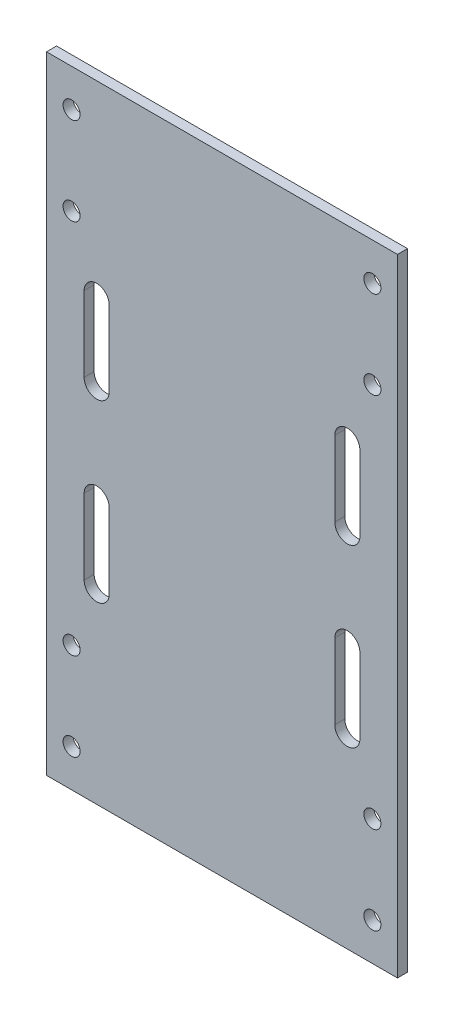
ISO-10303-21;
HEADER;
FILE_DESCRIPTION(('STEP AP214'),'2;1');
FILE_NAME('part.step','',(''),(''),'','','');
FILE_SCHEMA(('AUTOMOTIVE_DESIGN { 1 0 10303 214 1 1 1 1 }'));
ENDSEC;
DATA;
#1=APPLICATION_CONTEXT('core data for automotive mechanical design processes');
#2=APPLICATION_PROTOCOL_DEFINITION('international standard','automotive_design',2000,#1);
#3=PRODUCT_CONTEXT('',#1,'mechanical');
#4=PRODUCT('Part','Part','',(#3));
#5=PRODUCT_RELATED_PRODUCT_CATEGORY('part','',(#4));
#6=PRODUCT_DEFINITION_FORMATION('','',#4);
#7=PRODUCT_DEFINITION_CONTEXT('part definition',#1,'design');
#8=PRODUCT_DEFINITION('design','',#6,#7);
#9=PRODUCT_DEFINITION_SHAPE('','',#8);
#10=(LENGTH_UNIT() NAMED_UNIT(*) SI_UNIT(.MILLI.,.METRE.));
#11=(NAMED_UNIT(*) PLANE_ANGLE_UNIT() SI_UNIT($,.RADIAN.));
#12=(NAMED_UNIT(*) SI_UNIT($,.STERADIAN.) SOLID_ANGLE_UNIT());
#13=UNCERTAINTY_MEASURE_WITH_UNIT(LENGTH_MEASURE(1.E-05),#10,'distance_accuracy_value','');
#14=(GEOMETRIC_REPRESENTATION_CONTEXT(3) GLOBAL_UNCERTAINTY_ASSIGNED_CONTEXT((#13)) GLOBAL_UNIT_ASSIGNED_CONTEXT((#10,
#11,#12)) REPRESENTATION_CONTEXT('',''));
#15=CARTESIAN_POINT('',(0.,0.,0.));
#16=DIRECTION('',(0.,0.,1.));
#17=DIRECTION('',(1.,0.,0.));
#18=AXIS2_PLACEMENT_3D('',#15,#16,#17);
#19=CARTESIAN_POINT('',(0.,0.,0.));
#20=DIRECTION('',(0.,0.,-1.));
#21=DIRECTION('',(-1.,0.,0.));
#22=AXIS2_PLACEMENT_3D('',#19,#20,#21);
#23=PLANE('',#22);
#24=CARTESIAN_POINT('',(25.,-25.,0.));
#25=DIRECTION('',(0.,0.,-1.));
#26=DIRECTION('',(-1.,0.,0.));
#27=AXIS2_PLACEMENT_3D('',#24,#25,#26);
#28=CIRCLE('',#27,2.5);
#29=CARTESIAN_POINT('',(22.5,-25.,0.));
#30=VERTEX_POINT('',#29);
#31=CARTESIAN_POINT('',(27.5,-25.,0.));
#32=VERTEX_POINT('',#31);
#33=EDGE_CURVE('E514',#30,#32,#28,.F.);
#34=ORIENTED_EDGE('',*,*,#33,.F.);
#35=DIRECTION('',(0.,-1.,0.));
#36=VECTOR('',#35,1.);
#37=CARTESIAN_POINT('',(22.5,0.,0.));
#38=LINE('',#37,#36);
#39=CARTESIAN_POINT('',(22.5,-10.,0.));
#40=VERTEX_POINT('',#39);
#41=EDGE_CURVE('E261',#40,#30,#38,.T.);
#42=ORIENTED_EDGE('',*,*,#41,.F.);
#43=CARTESIAN_POINT('',(25.,-10.,0.));
#44=DIRECTION('',(0.,0.,-1.));
#45=DIRECTION('',(-1.,0.,0.));
#46=AXIS2_PLACEMENT_3D('',#43,#44,#45);
#47=CIRCLE('',#46,2.5);
#48=CARTESIAN_POINT('',(27.5,-10.,0.));
#49=VERTEX_POINT('',#48);
#50=EDGE_CURVE('E516',#49,#40,#47,.F.);
#51=ORIENTED_EDGE('',*,*,#50,.F.);
#52=DIRECTION('',(0.,1.,0.));
#53=VECTOR('',#52,1.);
#54=CARTESIAN_POINT('',(27.5,0.,0.));
#55=LINE('',#54,#53);
#56=EDGE_CURVE('E262',#32,#49,#55,.T.);
#57=ORIENTED_EDGE('',*,*,#56,.F.);
#58=EDGE_LOOP('',(#34,#42,#51,#57));
#59=FACE_BOUND('',#58,.T.);
#60=CARTESIAN_POINT('',(-25.,25.,0.));
#61=DIRECTION('',(0.,0.,-1.));
#62=DIRECTION('',(-1.,0.,0.));
#63=AXIS2_PLACEMENT_3D('',#60,#61,#62);
#64=CIRCLE('',#63,2.5);
#65=CARTESIAN_POINT('',(-22.5,25.,0.));
#66=VERTEX_POINT('',#65);
#67=CARTESIAN_POINT('',(-27.5,25.,0.));
#68=VERTEX_POINT('',#67);
#69=EDGE_CURVE('E518',#66,#68,#64,.F.);
#70=ORIENTED_EDGE('',*,*,#69,.F.);
#71=DIRECTION('',(0.,1.,0.));
#72=VECTOR('',#71,1.);
#73=CARTESIAN_POINT('',(-22.5,0.,0.));
#74=LINE('',#73,#72);
#75=CARTESIAN_POINT('',(-22.5,10.,0.));
#76=VERTEX_POINT('',#75);
#77=EDGE_CURVE('E269',#76,#66,#74,.T.);
#78=ORIENTED_EDGE('',*,*,#77,.F.);
#79=CARTESIAN_POINT('',(-25.,10.,0.));
#80=DIRECTION('',(0.,0.,-1.));
#81=DIRECTION('',(-1.,0.,0.));
#82=AXIS2_PLACEMENT_3D('',#79,#80,#81);
#83=CIRCLE('',#82,2.5);
#84=CARTESIAN_POINT('',(-27.5,10.,0.));
#85=VERTEX_POINT('',#84);
#86=EDGE_CURVE('E195',#85,#76,#83,.F.);
#87=ORIENTED_EDGE('',*,*,#86,.F.);
#88=DIRECTION('',(0.,-1.,0.));
#89=VECTOR('',#88,1.);
#90=CARTESIAN_POINT('',(-27.5,0.,0.));
#91=LINE('',#90,#89);
#92=EDGE_CURVE('E270',#68,#85,#91,.T.);
#93=ORIENTED_EDGE('',*,*,#92,.F.);
#94=EDGE_LOOP('',(#70,#78,#87,#93));
#95=FACE_BOUND('',#94,.T.);
#96=CARTESIAN_POINT('',(-25.,-10.,0.));
#97=DIRECTION('',(0.,0.,-1.));
#98=DIRECTION('',(-1.,0.,0.));
#99=AXIS2_PLACEMENT_3D('',#96,#97,#98);
#100=CIRCLE('',#99,2.5);
#101=CARTESIAN_POINT('',(-22.5,-10.,0.));
#102=VERTEX_POINT('',#101);
#103=CARTESIAN_POINT('',(-27.5,-10.,0.));
#104=VERTEX_POINT('',#103);
#105=EDGE_CURVE('E535',#102,#104,#100,.F.);
#106=ORIENTED_EDGE('',*,*,#105,.F.);
#107=DIRECTION('',(0.,1.,0.));
#108=VECTOR('',#107,1.);
#109=CARTESIAN_POINT('',(-22.5,0.,0.));
#110=LINE('',#109,#108);
#111=CARTESIAN_POINT('',(-22.5,-25.,0.));
#112=VERTEX_POINT('',#111);
#113=EDGE_CURVE('E252',#112,#102,#110,.T.);
#114=ORIENTED_EDGE('',*,*,#113,.F.);
#115=CARTESIAN_POINT('',(-25.,-25.,0.));
#116=DIRECTION('',(0.,0.,-1.));
#117=DIRECTION('',(-1.,0.,0.));
#118=AXIS2_PLACEMENT_3D('',#115,#116,#117);
#119=CIRCLE('',#118,2.5);
#120=CARTESIAN_POINT('',(-27.5,-25.,0.));
#121=VERTEX_POINT('',#120);
#122=EDGE_CURVE('E529',#121,#112,#119,.F.);
#123=ORIENTED_EDGE('',*,*,#122,.F.);
#124=DIRECTION('',(0.,-1.,0.));
#125=VECTOR('',#124,1.);
#126=CARTESIAN_POINT('',(-27.5,0.,0.));
#127=LINE('',#126,#125);
#128=EDGE_CURVE('E248',#104,#121,#127,.T.);
#129=ORIENTED_EDGE('',*,*,#128,.F.);
#130=EDGE_LOOP('',(#106,#114,#123,#129));
#131=FACE_BOUND('',#130,.T.);
#132=CARTESIAN_POINT('',(25.,10.,0.));
#133=DIRECTION('',(0.,0.,-1.));
#134=DIRECTION('',(-1.,0.,0.));
#135=AXIS2_PLACEMENT_3D('',#132,#133,#134);
#136=CIRCLE('',#135,2.5);
#137=CARTESIAN_POINT('',(22.5,10.,0.));
#138=VERTEX_POINT('',#137);
#139=CARTESIAN_POINT('',(27.5,10.,0.));
#140=VERTEX_POINT('',#139);
#141=EDGE_CURVE('E525',#138,#140,#136,.F.);
#142=ORIENTED_EDGE('',*,*,#141,.F.);
#143=DIRECTION('',(0.,-1.,0.));
#144=VECTOR('',#143,1.);
#145=CARTESIAN_POINT('',(22.5,0.,0.));
#146=LINE('',#145,#144);
#147=CARTESIAN_POINT('',(22.5,25.,0.));
#148=VERTEX_POINT('',#147);
#149=EDGE_CURVE('E254',#148,#138,#146,.T.);
#150=ORIENTED_EDGE('',*,*,#149,.F.);
#151=CARTESIAN_POINT('',(25.,25.,0.));
#152=DIRECTION('',(0.,0.,-1.));
#153=DIRECTION('',(-1.,0.,0.));
#154=AXIS2_PLACEMENT_3D('',#151,#152,#153);
#155=CIRCLE('',#154,2.5);
#156=CARTESIAN_POINT('',(27.5,25.,0.));
#157=VERTEX_POINT('',#156);
#158=EDGE_CURVE('E526',#157,#148,#155,.F.);
#159=ORIENTED_EDGE('',*,*,#158,.F.);
#160=DIRECTION('',(0.,1.,0.));
#161=VECTOR('',#160,1.);
#162=CARTESIAN_POINT('',(27.5,0.,0.));
#163=LINE('',#162,#161);
#164=EDGE_CURVE('E256',#140,#157,#163,.T.);
#165=ORIENTED_EDGE('',*,*,#164,.F.);
#166=EDGE_LOOP('',(#142,#150,#159,#165));
#167=FACE_BOUND('',#166,.T.);
#168=DIRECTION('',(0.,1.,0.));
#169=VECTOR('',#168,1.);
#170=CARTESIAN_POINT('',(35.,-62.5,0.));
#171=LINE('',#170,#169);
#172=CARTESIAN_POINT('',(35.,-62.5,0.));
#173=VERTEX_POINT('',#172);
#174=CARTESIAN_POINT('',(35.,62.5,0.));
#175=VERTEX_POINT('',#174);
#176=EDGE_CURVE('E825',#173,#175,#171,.T.);
#177=ORIENTED_EDGE('',*,*,#176,.T.);
#178=DIRECTION('',(-1.,0.,0.));
#179=VECTOR('',#178,1.);
#180=CARTESIAN_POINT('',(-35.,62.5,0.));
#181=LINE('',#180,#179);
#182=CARTESIAN_POINT('',(-35.,62.5,0.));
#183=VERTEX_POINT('',#182);
#184=EDGE_CURVE('E824',#175,#183,#181,.T.);
#185=ORIENTED_EDGE('',*,*,#184,.T.);
#186=DIRECTION('',(0.,-1.,0.));
#187=VECTOR('',#186,1.);
#188=CARTESIAN_POINT('',(-35.,-62.5,0.));
#189=LINE('',#188,#187);
#190=CARTESIAN_POINT('',(-35.,-62.5,0.));
#191=VERTEX_POINT('',#190);
#192=EDGE_CURVE('E826',#183,#191,#189,.T.);
#193=ORIENTED_EDGE('',*,*,#192,.T.);
#194=DIRECTION('',(1.,0.,0.));
#195=VECTOR('',#194,1.);
#196=CARTESIAN_POINT('',(-35.,-62.5,0.));
#197=LINE('',#196,#195);
#198=EDGE_CURVE('E830',#191,#173,#197,.T.);
#199=ORIENTED_EDGE('',*,*,#198,.T.);
#200=EDGE_LOOP('',(#177,#185,#193,#199));
#201=FACE_BOUND('',#200,.T.);
#202=CARTESIAN_POINT('',(-30.,-55.,1.2E-05));
#203=DIRECTION('',(0.,0.,1.));
#204=DIRECTION('',(1.,0.,0.));
#205=AXIS2_PLACEMENT_3D('',#202,#203,#204);
#206=CIRCLE('',#205,1.7);
#207=CARTESIAN_POINT('',(-28.3,-55.,1.2E-05));
#208=VERTEX_POINT('',#207);
#209=EDGE_CURVE('E302',#208,#208,#206,.T.);
#210=ORIENTED_EDGE('',*,*,#209,.F.);
#211=EDGE_LOOP('',(#210));
#212=FACE_BOUND('',#211,.T.);
#213=CARTESIAN_POINT('',(30.,55.,1.2E-05));
#214=DIRECTION('',(0.,0.,1.));
#215=DIRECTION('',(1.,0.,0.));
#216=AXIS2_PLACEMENT_3D('',#213,#214,#215);
#217=CIRCLE('',#216,1.7);
#218=CARTESIAN_POINT('',(31.7,55.,1.2E-05));
#219=VERTEX_POINT('',#218);
#220=EDGE_CURVE('E275',#219,#219,#217,.T.);
#221=ORIENTED_EDGE('',*,*,#220,.F.);
#222=EDGE_LOOP('',(#221));
#223=FACE_BOUND('',#222,.T.);
#224=CARTESIAN_POINT('',(30.,37.5,1.2E-05));
#225=DIRECTION('',(0.,0.,1.));
#226=DIRECTION('',(1.,0.,0.));
#227=AXIS2_PLACEMENT_3D('',#224,#225,#226);
#228=CIRCLE('',#227,1.7);
#229=CARTESIAN_POINT('',(31.7,37.5,1.2E-05));
#230=VERTEX_POINT('',#229);
#231=EDGE_CURVE('E282',#230,#230,#228,.T.);
#232=ORIENTED_EDGE('',*,*,#231,.F.);
#233=EDGE_LOOP('',(#232));
#234=FACE_BOUND('',#233,.T.);
#235=CARTESIAN_POINT('',(30.,-37.5,1.2E-05));
#236=DIRECTION('',(0.,0.,1.));
#237=DIRECTION('',(1.,0.,0.));
#238=AXIS2_PLACEMENT_3D('',#235,#236,#237);
#239=CIRCLE('',#238,1.7);
#240=CARTESIAN_POINT('',(31.7,-37.5,1.2E-05));
#241=VERTEX_POINT('',#240);
#242=EDGE_CURVE('E280',#241,#241,#239,.T.);
#243=ORIENTED_EDGE('',*,*,#242,.F.);
#244=EDGE_LOOP('',(#243));
#245=FACE_BOUND('',#244,.T.);
#246=CARTESIAN_POINT('',(-30.,-37.5,1.2E-05));
#247=DIRECTION('',(0.,0.,1.));
#248=DIRECTION('',(1.,0.,0.));
#249=AXIS2_PLACEMENT_3D('',#246,#247,#248);
#250=CIRCLE('',#249,1.7);
#251=CARTESIAN_POINT('',(-28.3,-37.5,1.2E-05));
#252=VERTEX_POINT('',#251);
#253=EDGE_CURVE('E299',#252,#252,#250,.T.);
#254=ORIENTED_EDGE('',*,*,#253,.F.);
#255=EDGE_LOOP('',(#254));
#256=FACE_BOUND('',#255,.T.);
#257=CARTESIAN_POINT('',(-30.,37.5,1.2E-05));
#258=DIRECTION('',(0.,0.,1.));
#259=DIRECTION('',(1.,0.,0.));
#260=AXIS2_PLACEMENT_3D('',#257,#258,#259);
#261=CIRCLE('',#260,1.7);
#262=CARTESIAN_POINT('',(-28.3,37.5,1.2E-05));
#263=VERTEX_POINT('',#262);
#264=EDGE_CURVE('E287',#263,#263,#261,.T.);
#265=ORIENTED_EDGE('',*,*,#264,.F.);
#266=EDGE_LOOP('',(#265));
#267=FACE_BOUND('',#266,.T.);
#268=CARTESIAN_POINT('',(-30.,55.,1.2E-05));
#269=DIRECTION('',(0.,0.,1.));
#270=DIRECTION('',(1.,0.,0.));
#271=AXIS2_PLACEMENT_3D('',#268,#269,#270);
#272=CIRCLE('',#271,1.7);
#273=CARTESIAN_POINT('',(-28.3,55.,1.2E-05));
#274=VERTEX_POINT('',#273);
#275=EDGE_CURVE('E288',#274,#274,#272,.T.);
#276=ORIENTED_EDGE('',*,*,#275,.F.);
#277=EDGE_LOOP('',(#276));
#278=FACE_BOUND('',#277,.T.);
#279=CARTESIAN_POINT('',(30.,-55.,1.2E-05));
#280=DIRECTION('',(0.,0.,1.));
#281=DIRECTION('',(1.,0.,0.));
#282=AXIS2_PLACEMENT_3D('',#279,#280,#281);
#283=CIRCLE('',#282,1.7);
#284=CARTESIAN_POINT('',(31.7,-55.,1.2E-05));
#285=VERTEX_POINT('',#284);
#286=EDGE_CURVE('E277',#285,#285,#283,.T.);
#287=ORIENTED_EDGE('',*,*,#286,.F.);
#288=EDGE_LOOP('',(#287));
#289=FACE_BOUND('',#288,.T.);
#290=ADVANCED_FACE('F39',(#59,#95,#131,#167,#201,#212,#223,#234,#245,#256,#267,#278,#289),#23,.F.);
#291=CARTESIAN_POINT('',(0.,0.,-2.));
#292=DIRECTION('',(0.,0.,-1.));
#293=DIRECTION('',(-1.,0.,0.));
#294=AXIS2_PLACEMENT_3D('',#291,#292,#293);
#295=PLANE('',#294);
#296=CARTESIAN_POINT('',(30.,-55.,-2.));
#297=DIRECTION('',(0.,0.,1.));
#298=DIRECTION('',(1.,0.,0.));
#299=AXIS2_PLACEMENT_3D('',#296,#297,#298);
#300=CIRCLE('',#299,1.7);
#301=CARTESIAN_POINT('',(31.7,-55.,-2.));
#302=VERTEX_POINT('',#301);
#303=EDGE_CURVE('E289',#302,#302,#300,.T.);
#304=ORIENTED_EDGE('',*,*,#303,.T.);
#305=EDGE_LOOP('',(#304));
#306=FACE_BOUND('',#305,.T.);
#307=CARTESIAN_POINT('',(-30.,55.,-2.));
#308=DIRECTION('',(0.,0.,1.));
#309=DIRECTION('',(1.,0.,0.));
#310=AXIS2_PLACEMENT_3D('',#307,#308,#309);
#311=CIRCLE('',#310,1.7);
#312=CARTESIAN_POINT('',(-28.3,55.,-2.));
#313=VERTEX_POINT('',#312);
#314=EDGE_CURVE('E283',#313,#313,#311,.T.);
#315=ORIENTED_EDGE('',*,*,#314,.T.);
#316=EDGE_LOOP('',(#315));
#317=FACE_BOUND('',#316,.T.);
#318=CARTESIAN_POINT('',(-30.,37.5,-2.));
#319=DIRECTION('',(0.,0.,1.));
#320=DIRECTION('',(1.,0.,0.));
#321=AXIS2_PLACEMENT_3D('',#318,#319,#320);
#322=CIRCLE('',#321,1.7);
#323=CARTESIAN_POINT('',(-28.3,37.5,-2.));
#324=VERTEX_POINT('',#323);
#325=EDGE_CURVE('E300',#324,#324,#322,.T.);
#326=ORIENTED_EDGE('',*,*,#325,.T.);
#327=EDGE_LOOP('',(#326));
#328=FACE_BOUND('',#327,.T.);
#329=CARTESIAN_POINT('',(-30.,-37.5,-2.));
#330=DIRECTION('',(0.,0.,1.));
#331=DIRECTION('',(1.,0.,0.));
#332=AXIS2_PLACEMENT_3D('',#329,#330,#331);
#333=CIRCLE('',#332,1.7);
#334=CARTESIAN_POINT('',(-28.3,-37.5,-2.));
#335=VERTEX_POINT('',#334);
#336=EDGE_CURVE('E291',#335,#335,#333,.T.);
#337=ORIENTED_EDGE('',*,*,#336,.T.);
#338=EDGE_LOOP('',(#337));
#339=FACE_BOUND('',#338,.T.);
#340=CARTESIAN_POINT('',(30.,-37.5,-2.));
#341=DIRECTION('',(0.,0.,1.));
#342=DIRECTION('',(1.,0.,0.));
#343=AXIS2_PLACEMENT_3D('',#340,#341,#342);
#344=CIRCLE('',#343,1.7);
#345=CARTESIAN_POINT('',(31.7,-37.5,-2.));
#346=VERTEX_POINT('',#345);
#347=EDGE_CURVE('E272',#346,#346,#344,.T.);
#348=ORIENTED_EDGE('',*,*,#347,.T.);
#349=EDGE_LOOP('',(#348));
#350=FACE_BOUND('',#349,.T.);
#351=CARTESIAN_POINT('',(30.,37.5,-2.));
#352=DIRECTION('',(0.,0.,1.));
#353=DIRECTION('',(1.,0.,0.));
#354=AXIS2_PLACEMENT_3D('',#351,#352,#353);
#355=CIRCLE('',#354,1.7);
#356=CARTESIAN_POINT('',(31.7,37.5,-2.));
#357=VERTEX_POINT('',#356);
#358=EDGE_CURVE('E279',#357,#357,#355,.T.);
#359=ORIENTED_EDGE('',*,*,#358,.T.);
#360=EDGE_LOOP('',(#359));
#361=FACE_BOUND('',#360,.T.);
#362=CARTESIAN_POINT('',(30.,55.,-2.));
#363=DIRECTION('',(0.,0.,1.));
#364=DIRECTION('',(1.,0.,0.));
#365=AXIS2_PLACEMENT_3D('',#362,#363,#364);
#366=CIRCLE('',#365,1.7);
#367=CARTESIAN_POINT('',(31.7,55.,-2.));
#368=VERTEX_POINT('',#367);
#369=EDGE_CURVE('E284',#368,#368,#366,.T.);
#370=ORIENTED_EDGE('',*,*,#369,.T.);
#371=EDGE_LOOP('',(#370));
#372=FACE_BOUND('',#371,.T.);
#373=CARTESIAN_POINT('',(-30.,-55.,-2.));
#374=DIRECTION('',(0.,0.,1.));
#375=DIRECTION('',(1.,0.,0.));
#376=AXIS2_PLACEMENT_3D('',#373,#374,#375);
#377=CIRCLE('',#376,1.7);
#378=CARTESIAN_POINT('',(-28.3,-55.,-2.));
#379=VERTEX_POINT('',#378);
#380=EDGE_CURVE('E297',#379,#379,#377,.T.);
#381=ORIENTED_EDGE('',*,*,#380,.T.);
#382=EDGE_LOOP('',(#381));
#383=FACE_BOUND('',#382,.T.);
#384=DIRECTION('',(0.,1.,0.));
#385=VECTOR('',#384,1.);
#386=CARTESIAN_POINT('',(35.,-62.5,-2.));
#387=LINE('',#386,#385);
#388=CARTESIAN_POINT('',(35.,-62.5,-2.));
#389=VERTEX_POINT('',#388);
#390=CARTESIAN_POINT('',(35.,62.5,-2.));
#391=VERTEX_POINT('',#390);
#392=EDGE_CURVE('E405',#389,#391,#387,.T.);
#393=ORIENTED_EDGE('',*,*,#392,.F.);
#394=DIRECTION('',(1.,0.,0.));
#395=VECTOR('',#394,1.);
#396=CARTESIAN_POINT('',(-35.,-62.5,-2.));
#397=LINE('',#396,#395);
#398=CARTESIAN_POINT('',(-35.,-62.5,-2.));
#399=VERTEX_POINT('',#398);
#400=EDGE_CURVE('E837',#399,#389,#397,.T.);
#401=ORIENTED_EDGE('',*,*,#400,.F.);
#402=DIRECTION('',(0.,-1.,0.));
#403=VECTOR('',#402,1.);
#404=CARTESIAN_POINT('',(-35.,-62.5,-2.));
#405=LINE('',#404,#403);
#406=CARTESIAN_POINT('',(-35.,62.5,-2.));
#407=VERTEX_POINT('',#406);
#408=EDGE_CURVE('E862',#407,#399,#405,.T.);
#409=ORIENTED_EDGE('',*,*,#408,.F.);
#410=DIRECTION('',(-1.,0.,0.));
#411=VECTOR('',#410,1.);
#412=CARTESIAN_POINT('',(-35.,62.5,-2.));
#413=LINE('',#412,#411);
#414=EDGE_CURVE('E832',#391,#407,#413,.T.);
#415=ORIENTED_EDGE('',*,*,#414,.F.);
#416=EDGE_LOOP('',(#393,#401,#409,#415));
#417=FACE_BOUND('',#416,.T.);
#418=DIRECTION('',(0.,1.,0.));
#419=VECTOR('',#418,1.);
#420=CARTESIAN_POINT('',(-22.5,-25.,-2.));
#421=LINE('',#420,#419);
#422=CARTESIAN_POINT('',(-22.5,-25.,-2.));
#423=VERTEX_POINT('',#422);
#424=CARTESIAN_POINT('',(-22.5,-10.,-2.));
#425=VERTEX_POINT('',#424);
#426=EDGE_CURVE('E213',#423,#425,#421,.T.);
#427=ORIENTED_EDGE('',*,*,#426,.T.);
#428=CARTESIAN_POINT('',(-25.,-10.,-2.));
#429=DIRECTION('',(0.,0.,1.));
#430=DIRECTION('',(1.,0.,0.));
#431=AXIS2_PLACEMENT_3D('',#428,#429,#430);
#432=CIRCLE('',#431,2.5);
#433=CARTESIAN_POINT('',(-27.5,-10.,-2.));
#434=VERTEX_POINT('',#433);
#435=EDGE_CURVE('E210',#425,#434,#432,.T.);
#436=ORIENTED_EDGE('',*,*,#435,.T.);
#437=DIRECTION('',(0.,-1.,0.));
#438=VECTOR('',#437,1.);
#439=CARTESIAN_POINT('',(-27.5,-25.,-2.));
#440=LINE('',#439,#438);
#441=CARTESIAN_POINT('',(-27.5,-25.,-2.));
#442=VERTEX_POINT('',#441);
#443=EDGE_CURVE('E216',#434,#442,#440,.T.);
#444=ORIENTED_EDGE('',*,*,#443,.T.);
#445=CARTESIAN_POINT('',(-25.,-25.,-2.));
#446=DIRECTION('',(0.,0.,1.));
#447=DIRECTION('',(1.,0.,0.));
#448=AXIS2_PLACEMENT_3D('',#445,#446,#447);
#449=CIRCLE('',#448,2.5);
#450=EDGE_CURVE('E557',#442,#423,#449,.T.);
#451=ORIENTED_EDGE('',*,*,#450,.T.);
#452=EDGE_LOOP('',(#427,#436,#444,#451));
#453=FACE_BOUND('',#452,.T.);
#454=DIRECTION('',(0.,-1.,0.));
#455=VECTOR('',#454,1.);
#456=CARTESIAN_POINT('',(22.5,10.,-2.));
#457=LINE('',#456,#455);
#458=CARTESIAN_POINT('',(22.5,25.,-2.));
#459=VERTEX_POINT('',#458);
#460=CARTESIAN_POINT('',(22.5,10.,-2.));
#461=VERTEX_POINT('',#460);
#462=EDGE_CURVE('E498',#459,#461,#457,.T.);
#463=ORIENTED_EDGE('',*,*,#462,.T.);
#464=CARTESIAN_POINT('',(25.,10.,-2.));
#465=DIRECTION('',(0.,0.,1.));
#466=DIRECTION('',(1.,0.,0.));
#467=AXIS2_PLACEMENT_3D('',#464,#465,#466);
#468=CIRCLE('',#467,2.5);
#469=CARTESIAN_POINT('',(27.5,10.,-2.));
#470=VERTEX_POINT('',#469);
#471=EDGE_CURVE('E563',#461,#470,#468,.T.);
#472=ORIENTED_EDGE('',*,*,#471,.T.);
#473=DIRECTION('',(0.,1.,0.));
#474=VECTOR('',#473,1.);
#475=CARTESIAN_POINT('',(27.5,10.,-2.));
#476=LINE('',#475,#474);
#477=CARTESIAN_POINT('',(27.5,25.,-2.));
#478=VERTEX_POINT('',#477);
#479=EDGE_CURVE('E221',#470,#478,#476,.T.);
#480=ORIENTED_EDGE('',*,*,#479,.T.);
#481=CARTESIAN_POINT('',(25.,25.,-2.));
#482=DIRECTION('',(0.,0.,1.));
#483=DIRECTION('',(1.,0.,0.));
#484=AXIS2_PLACEMENT_3D('',#481,#482,#483);
#485=CIRCLE('',#484,2.5);
#486=EDGE_CURVE('E565',#478,#459,#485,.T.);
#487=ORIENTED_EDGE('',*,*,#486,.T.);
#488=EDGE_LOOP('',(#463,#472,#480,#487));
#489=FACE_BOUND('',#488,.T.);
#490=DIRECTION('',(0.,-1.,0.));
#491=VECTOR('',#490,1.);
#492=CARTESIAN_POINT('',(22.5,-25.,-2.));
#493=LINE('',#492,#491);
#494=CARTESIAN_POINT('',(22.5,-10.,-2.));
#495=VERTEX_POINT('',#494);
#496=CARTESIAN_POINT('',(22.5,-25.,-2.));
#497=VERTEX_POINT('',#496);
#498=EDGE_CURVE('E231',#495,#497,#493,.T.);
#499=ORIENTED_EDGE('',*,*,#498,.T.);
#500=CARTESIAN_POINT('',(25.,-25.,-2.));
#501=DIRECTION('',(0.,0.,1.));
#502=DIRECTION('',(1.,0.,0.));
#503=AXIS2_PLACEMENT_3D('',#500,#501,#502);
#504=CIRCLE('',#503,2.5);
#505=CARTESIAN_POINT('',(27.5,-25.,-2.));
#506=VERTEX_POINT('',#505);
#507=EDGE_CURVE('E501',#497,#506,#504,.T.);
#508=ORIENTED_EDGE('',*,*,#507,.T.);
#509=DIRECTION('',(0.,1.,0.));
#510=VECTOR('',#509,1.);
#511=CARTESIAN_POINT('',(27.5,-25.,-2.));
#512=LINE('',#511,#510);
#513=CARTESIAN_POINT('',(27.5,-10.,-2.));
#514=VERTEX_POINT('',#513);
#515=EDGE_CURVE('E233',#506,#514,#512,.T.);
#516=ORIENTED_EDGE('',*,*,#515,.T.);
#517=CARTESIAN_POINT('',(25.,-10.,-2.));
#518=DIRECTION('',(0.,0.,1.));
#519=DIRECTION('',(1.,0.,0.));
#520=AXIS2_PLACEMENT_3D('',#517,#518,#519);
#521=CIRCLE('',#520,2.5);
#522=EDGE_CURVE('E506',#514,#495,#521,.T.);
#523=ORIENTED_EDGE('',*,*,#522,.T.);
#524=EDGE_LOOP('',(#499,#508,#516,#523));
#525=FACE_BOUND('',#524,.T.);
#526=DIRECTION('',(0.,1.,0.));
#527=VECTOR('',#526,1.);
#528=CARTESIAN_POINT('',(-22.5,10.,-2.));
#529=LINE('',#528,#527);
#530=CARTESIAN_POINT('',(-22.5,10.,-2.));
#531=VERTEX_POINT('',#530);
#532=CARTESIAN_POINT('',(-22.5,25.,-2.));
#533=VERTEX_POINT('',#532);
#534=EDGE_CURVE('E202',#531,#533,#529,.T.);
#535=ORIENTED_EDGE('',*,*,#534,.T.);
#536=CARTESIAN_POINT('',(-25.,25.,-2.));
#537=DIRECTION('',(0.,0.,1.));
#538=DIRECTION('',(1.,0.,0.));
#539=AXIS2_PLACEMENT_3D('',#536,#537,#538);
#540=CIRCLE('',#539,2.5);
#541=CARTESIAN_POINT('',(-27.5,25.,-2.));
#542=VERTEX_POINT('',#541);
#543=EDGE_CURVE('E208',#533,#542,#540,.T.);
#544=ORIENTED_EDGE('',*,*,#543,.T.);
#545=DIRECTION('',(0.,-1.,0.));
#546=VECTOR('',#545,1.);
#547=CARTESIAN_POINT('',(-27.5,10.,-2.));
#548=LINE('',#547,#546);
#549=CARTESIAN_POINT('',(-27.5,10.,-2.));
#550=VERTEX_POINT('',#549);
#551=EDGE_CURVE('E197',#542,#550,#548,.T.);
#552=ORIENTED_EDGE('',*,*,#551,.T.);
#553=CARTESIAN_POINT('',(-25.,10.,-2.));
#554=DIRECTION('',(0.,0.,1.));
#555=DIRECTION('',(1.,0.,0.));
#556=AXIS2_PLACEMENT_3D('',#553,#554,#555);
#557=CIRCLE('',#556,2.5);
#558=EDGE_CURVE('E186',#550,#531,#557,.T.);
#559=ORIENTED_EDGE('',*,*,#558,.T.);
#560=EDGE_LOOP('',(#535,#544,#552,#559));
#561=FACE_BOUND('',#560,.T.);
#562=ADVANCED_FACE('F201',(#306,#317,#328,#339,#350,#361,#372,#383,#417,#453,#489,#525,#561),
#295,.T.);
#563=CARTESIAN_POINT('',(35.,-62.5,-2.));
#564=DIRECTION('',(1.,0.,0.));
#565=DIRECTION('',(0.,0.,-1.));
#566=AXIS2_PLACEMENT_3D('',#563,#564,#565);
#567=PLANE('',#566);
#568=ORIENTED_EDGE('',*,*,#176,.F.);
#569=DIRECTION('',(0.,0.,1.));
#570=VECTOR('',#569,1.);
#571=CARTESIAN_POINT('',(35.,-62.5,-2.));
#572=LINE('',#571,#570);
#573=EDGE_CURVE('E11',#389,#173,#572,.T.);
#574=ORIENTED_EDGE('',*,*,#573,.F.);
#575=ORIENTED_EDGE('',*,*,#392,.T.);
#576=DIRECTION('',(0.,0.,1.));
#577=VECTOR('',#576,1.);
#578=CARTESIAN_POINT('',(35.,62.5,-2.));
#579=LINE('',#578,#577);
#580=EDGE_CURVE('E88',#391,#175,#579,.T.);
#581=ORIENTED_EDGE('',*,*,#580,.T.);
#582=EDGE_LOOP('',(#568,#574,#575,#581));
#583=FACE_BOUND('',#582,.T.);
#584=ADVANCED_FACE('F41',(#583),#567,.T.);
#585=CARTESIAN_POINT('',(-35.,-62.5,-2.));
#586=DIRECTION('',(0.,-1.,0.));
#587=DIRECTION('',(0.,0.,-1.));
#588=AXIS2_PLACEMENT_3D('',#585,#586,#587);
#589=PLANE('',#588);
#590=ORIENTED_EDGE('',*,*,#198,.F.);
#591=DIRECTION('',(0.,0.,1.));
#592=VECTOR('',#591,1.);
#593=CARTESIAN_POINT('',(-35.,-62.5,-2.));
#594=LINE('',#593,#592);
#595=EDGE_CURVE('E51',#399,#191,#594,.T.);
#596=ORIENTED_EDGE('',*,*,#595,.F.);
#597=ORIENTED_EDGE('',*,*,#400,.T.);
#598=ORIENTED_EDGE('',*,*,#573,.T.);
#599=EDGE_LOOP('',(#590,#596,#597,#598));
#600=FACE_BOUND('',#599,.T.);
#601=ADVANCED_FACE('F419',(#600),#589,.T.);
#602=CARTESIAN_POINT('',(-35.,-62.5,-2.));
#603=DIRECTION('',(-1.,0.,0.));
#604=DIRECTION('',(0.,0.,1.));
#605=AXIS2_PLACEMENT_3D('',#602,#603,#604);
#606=PLANE('',#605);
#607=ORIENTED_EDGE('',*,*,#192,.F.);
#608=DIRECTION('',(0.,0.,1.));
#609=VECTOR('',#608,1.);
#610=CARTESIAN_POINT('',(-35.,62.5,-2.));
#611=LINE('',#610,#609);
#612=EDGE_CURVE('E836',#407,#183,#611,.T.);
#613=ORIENTED_EDGE('',*,*,#612,.F.);
#614=ORIENTED_EDGE('',*,*,#408,.T.);
#615=ORIENTED_EDGE('',*,*,#595,.T.);
#616=EDGE_LOOP('',(#607,#613,#614,#615));
#617=FACE_BOUND('',#616,.T.);
#618=ADVANCED_FACE('F699',(#617),#606,.T.);
#619=CARTESIAN_POINT('',(-35.,62.5,-2.));
#620=DIRECTION('',(0.,1.,0.));
#621=DIRECTION('',(0.,0.,1.));
#622=AXIS2_PLACEMENT_3D('',#619,#620,#621);
#623=PLANE('',#622);
#624=ORIENTED_EDGE('',*,*,#184,.F.);
#625=ORIENTED_EDGE('',*,*,#580,.F.);
#626=ORIENTED_EDGE('',*,*,#414,.T.);
#627=ORIENTED_EDGE('',*,*,#612,.T.);
#628=EDGE_LOOP('',(#624,#625,#626,#627));
#629=FACE_BOUND('',#628,.T.);
#630=ADVANCED_FACE('F412',(#629),#623,.T.);
#631=CARTESIAN_POINT('',(-30.,-55.,1.2E-05));
#632=DIRECTION('',(0.,0.,-1.));
#633=DIRECTION('',(-1.,0.,0.));
#634=AXIS2_PLACEMENT_3D('',#631,#632,#633);
#635=CYLINDRICAL_SURFACE('',#634,1.7);
#636=ORIENTED_EDGE('',*,*,#209,.T.);
#637=EDGE_LOOP('',(#636));
#638=FACE_BOUND('',#637,.T.);
#639=ORIENTED_EDGE('',*,*,#380,.F.);
#640=EDGE_LOOP('',(#639));
#641=FACE_BOUND('',#640,.T.);
#642=ADVANCED_FACE('F404',(#638,#641),#635,.F.);
#643=CARTESIAN_POINT('',(30.,55.,1.2E-05));
#644=DIRECTION('',(0.,0.,-1.));
#645=DIRECTION('',(-1.,0.,0.));
#646=AXIS2_PLACEMENT_3D('',#643,#644,#645);
#647=CYLINDRICAL_SURFACE('',#646,1.7);
#648=ORIENTED_EDGE('',*,*,#220,.T.);
#649=EDGE_LOOP('',(#648));
#650=FACE_BOUND('',#649,.T.);
#651=ORIENTED_EDGE('',*,*,#369,.F.);
#652=EDGE_LOOP('',(#651));
#653=FACE_BOUND('',#652,.T.);
#654=ADVANCED_FACE('F375',(#650,#653),#647,.F.);
#655=CARTESIAN_POINT('',(30.,37.5,1.2E-05));
#656=DIRECTION('',(0.,0.,-1.));
#657=DIRECTION('',(-1.,0.,0.));
#658=AXIS2_PLACEMENT_3D('',#655,#656,#657);
#659=CYLINDRICAL_SURFACE('',#658,1.7);
#660=ORIENTED_EDGE('',*,*,#231,.T.);
#661=EDGE_LOOP('',(#660));
#662=FACE_BOUND('',#661,.T.);
#663=ORIENTED_EDGE('',*,*,#358,.F.);
#664=EDGE_LOOP('',(#663));
#665=FACE_BOUND('',#664,.T.);
#666=ADVANCED_FACE('F366',(#662,#665),#659,.F.);
#667=CARTESIAN_POINT('',(30.,-37.5,1.2E-05));
#668=DIRECTION('',(0.,0.,-1.));
#669=DIRECTION('',(-1.,0.,0.));
#670=AXIS2_PLACEMENT_3D('',#667,#668,#669);
#671=CYLINDRICAL_SURFACE('',#670,1.7);
#672=ORIENTED_EDGE('',*,*,#242,.T.);
#673=EDGE_LOOP('',(#672));
#674=FACE_BOUND('',#673,.T.);
#675=ORIENTED_EDGE('',*,*,#347,.F.);
#676=EDGE_LOOP('',(#675));
#677=FACE_BOUND('',#676,.T.);
#678=ADVANCED_FACE('F334',(#674,#677),#671,.F.);
#679=CARTESIAN_POINT('',(-30.,-37.5,1.2E-05));
#680=DIRECTION('',(0.,0.,-1.));
#681=DIRECTION('',(-1.,0.,0.));
#682=AXIS2_PLACEMENT_3D('',#679,#680,#681);
#683=CYLINDRICAL_SURFACE('',#682,1.7);
#684=ORIENTED_EDGE('',*,*,#253,.T.);
#685=EDGE_LOOP('',(#684));
#686=FACE_BOUND('',#685,.T.);
#687=ORIENTED_EDGE('',*,*,#336,.F.);
#688=EDGE_LOOP('',(#687));
#689=FACE_BOUND('',#688,.T.);
#690=ADVANCED_FACE('F327',(#686,#689),#683,.F.);
#691=CARTESIAN_POINT('',(-30.,37.5,1.2E-05));
#692=DIRECTION('',(0.,0.,-1.));
#693=DIRECTION('',(-1.,0.,0.));
#694=AXIS2_PLACEMENT_3D('',#691,#692,#693);
#695=CYLINDRICAL_SURFACE('',#694,1.7);
#696=ORIENTED_EDGE('',*,*,#264,.T.);
#697=EDGE_LOOP('',(#696));
#698=FACE_BOUND('',#697,.T.);
#699=ORIENTED_EDGE('',*,*,#325,.F.);
#700=EDGE_LOOP('',(#699));
#701=FACE_BOUND('',#700,.T.);
#702=ADVANCED_FACE('F335',(#698,#701),#695,.F.);
#703=CARTESIAN_POINT('',(-30.,55.,1.2E-05));
#704=DIRECTION('',(0.,0.,-1.));
#705=DIRECTION('',(-1.,0.,0.));
#706=AXIS2_PLACEMENT_3D('',#703,#704,#705);
#707=CYLINDRICAL_SURFACE('',#706,1.7);
#708=ORIENTED_EDGE('',*,*,#275,.T.);
#709=EDGE_LOOP('',(#708));
#710=FACE_BOUND('',#709,.T.);
#711=ORIENTED_EDGE('',*,*,#314,.F.);
#712=EDGE_LOOP('',(#711));
#713=FACE_BOUND('',#712,.T.);
#714=ADVANCED_FACE('F324',(#710,#713),#707,.F.);
#715=CARTESIAN_POINT('',(30.,-55.,1.2E-05));
#716=DIRECTION('',(0.,0.,-1.));
#717=DIRECTION('',(-1.,0.,0.));
#718=AXIS2_PLACEMENT_3D('',#715,#716,#717);
#719=CYLINDRICAL_SURFACE('',#718,1.7);
#720=ORIENTED_EDGE('',*,*,#286,.T.);
#721=EDGE_LOOP('',(#720));
#722=FACE_BOUND('',#721,.T.);
#723=ORIENTED_EDGE('',*,*,#303,.F.);
#724=EDGE_LOOP('',(#723));
#725=FACE_BOUND('',#724,.T.);
#726=ADVANCED_FACE('F314',(#722,#725),#719,.F.);
#727=CARTESIAN_POINT('',(-22.5,-25.,0.082677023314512));
#728=DIRECTION('',(-1.,0.,0.));
#729=DIRECTION('',(0.,0.,1.));
#730=AXIS2_PLACEMENT_3D('',#727,#728,#729);
#731=PLANE('',#730);
#732=ORIENTED_EDGE('',*,*,#113,.T.);
#733=DIRECTION('',(0.,0.,-1.));
#734=VECTOR('',#733,1.);
#735=CARTESIAN_POINT('',(-22.5,-10.,0.082677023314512));
#736=LINE('',#735,#734);
#737=EDGE_CURVE('E246',#102,#425,#736,.T.);
#738=ORIENTED_EDGE('',*,*,#737,.T.);
#739=ORIENTED_EDGE('',*,*,#426,.F.);
#740=DIRECTION('',(0.,0.,-1.));
#741=VECTOR('',#740,1.);
#742=CARTESIAN_POINT('',(-22.5,-25.,0.082677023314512));
#743=LINE('',#742,#741);
#744=EDGE_CURVE('E239',#112,#423,#743,.T.);
#745=ORIENTED_EDGE('',*,*,#744,.F.);
#746=EDGE_LOOP('',(#732,#738,#739,#745));
#747=FACE_BOUND('',#746,.T.);
#748=ADVANCED_FACE('F322',(#747),#731,.T.);
#749=CARTESIAN_POINT('',(-27.5,-25.,0.082677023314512));
#750=DIRECTION('',(1.,0.,0.));
#751=DIRECTION('',(0.,0.,-1.));
#752=AXIS2_PLACEMENT_3D('',#749,#750,#751);
#753=PLANE('',#752);
#754=ORIENTED_EDGE('',*,*,#128,.T.);
#755=DIRECTION('',(0.,0.,-1.));
#756=VECTOR('',#755,1.);
#757=CARTESIAN_POINT('',(-27.5,-25.,0.082677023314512));
#758=LINE('',#757,#756);
#759=EDGE_CURVE('E242',#121,#442,#758,.T.);
#760=ORIENTED_EDGE('',*,*,#759,.T.);
#761=ORIENTED_EDGE('',*,*,#443,.F.);
#762=DIRECTION('',(0.,0.,-1.));
#763=VECTOR('',#762,1.);
#764=CARTESIAN_POINT('',(-27.5,-10.,0.082677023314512));
#765=LINE('',#764,#763);
#766=EDGE_CURVE('E241',#104,#434,#765,.T.);
#767=ORIENTED_EDGE('',*,*,#766,.F.);
#768=EDGE_LOOP('',(#754,#760,#761,#767));
#769=FACE_BOUND('',#768,.T.);
#770=ADVANCED_FACE('F614',(#769),#753,.T.);
#771=CARTESIAN_POINT('',(27.5,10.,0.082677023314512));
#772=DIRECTION('',(-1.,0.,0.));
#773=DIRECTION('',(0.,0.,1.));
#774=AXIS2_PLACEMENT_3D('',#771,#772,#773);
#775=PLANE('',#774);
#776=ORIENTED_EDGE('',*,*,#164,.T.);
#777=DIRECTION('',(0.,0.,-1.));
#778=VECTOR('',#777,1.);
#779=CARTESIAN_POINT('',(27.5,25.,0.082677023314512));
#780=LINE('',#779,#778);
#781=EDGE_CURVE('E534',#157,#478,#780,.T.);
#782=ORIENTED_EDGE('',*,*,#781,.T.);
#783=ORIENTED_EDGE('',*,*,#479,.F.);
#784=DIRECTION('',(0.,0.,-1.));
#785=VECTOR('',#784,1.);
#786=CARTESIAN_POINT('',(27.5,10.,0.082677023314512));
#787=LINE('',#786,#785);
#788=EDGE_CURVE('E545',#140,#470,#787,.T.);
#789=ORIENTED_EDGE('',*,*,#788,.F.);
#790=EDGE_LOOP('',(#776,#782,#783,#789));
#791=FACE_BOUND('',#790,.T.);
#792=ADVANCED_FACE('F568',(#791),#775,.T.);
#793=CARTESIAN_POINT('',(22.5,10.,0.082677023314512));
#794=DIRECTION('',(1.,0.,0.));
#795=DIRECTION('',(0.,0.,-1.));
#796=AXIS2_PLACEMENT_3D('',#793,#794,#795);
#797=PLANE('',#796);
#798=ORIENTED_EDGE('',*,*,#149,.T.);
#799=DIRECTION('',(0.,0.,-1.));
#800=VECTOR('',#799,1.);
#801=CARTESIAN_POINT('',(22.5,10.,0.082677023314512));
#802=LINE('',#801,#800);
#803=EDGE_CURVE('E537',#138,#461,#802,.T.);
#804=ORIENTED_EDGE('',*,*,#803,.T.);
#805=ORIENTED_EDGE('',*,*,#462,.F.);
#806=DIRECTION('',(0.,0.,-1.));
#807=VECTOR('',#806,1.);
#808=CARTESIAN_POINT('',(22.5,25.,0.082677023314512));
#809=LINE('',#808,#807);
#810=EDGE_CURVE('E540',#148,#459,#809,.T.);
#811=ORIENTED_EDGE('',*,*,#810,.F.);
#812=EDGE_LOOP('',(#798,#804,#805,#811));
#813=FACE_BOUND('',#812,.T.);
#814=ADVANCED_FACE('F583',(#813),#797,.T.);
#815=CARTESIAN_POINT('',(27.5,-25.,0.082677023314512));
#816=DIRECTION('',(-1.,0.,0.));
#817=DIRECTION('',(0.,0.,1.));
#818=AXIS2_PLACEMENT_3D('',#815,#816,#817);
#819=PLANE('',#818);
#820=ORIENTED_EDGE('',*,*,#56,.T.);
#821=DIRECTION('',(0.,0.,-1.));
#822=VECTOR('',#821,1.);
#823=CARTESIAN_POINT('',(27.5,-10.,0.082677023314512));
#824=LINE('',#823,#822);
#825=EDGE_CURVE('E219',#49,#514,#824,.T.);
#826=ORIENTED_EDGE('',*,*,#825,.T.);
#827=ORIENTED_EDGE('',*,*,#515,.F.);
#828=DIRECTION('',(0.,0.,-1.));
#829=VECTOR('',#828,1.);
#830=CARTESIAN_POINT('',(27.5,-25.,0.082677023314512));
#831=LINE('',#830,#829);
#832=EDGE_CURVE('E226',#32,#506,#831,.T.);
#833=ORIENTED_EDGE('',*,*,#832,.F.);
#834=EDGE_LOOP('',(#820,#826,#827,#833));
#835=FACE_BOUND('',#834,.T.);
#836=ADVANCED_FACE('F613',(#835),#819,.T.);
#837=CARTESIAN_POINT('',(22.5,-25.,0.082677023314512));
#838=DIRECTION('',(1.,0.,0.));
#839=DIRECTION('',(0.,0.,-1.));
#840=AXIS2_PLACEMENT_3D('',#837,#838,#839);
#841=PLANE('',#840);
#842=ORIENTED_EDGE('',*,*,#41,.T.);
#843=DIRECTION('',(0.,0.,-1.));
#844=VECTOR('',#843,1.);
#845=CARTESIAN_POINT('',(22.5,-25.,0.082677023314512));
#846=LINE('',#845,#844);
#847=EDGE_CURVE('E227',#30,#497,#846,.T.);
#848=ORIENTED_EDGE('',*,*,#847,.T.);
#849=ORIENTED_EDGE('',*,*,#498,.F.);
#850=DIRECTION('',(0.,0.,-1.));
#851=VECTOR('',#850,1.);
#852=CARTESIAN_POINT('',(22.5,-10.,0.082677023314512));
#853=LINE('',#852,#851);
#854=EDGE_CURVE('E224',#40,#495,#853,.T.);
#855=ORIENTED_EDGE('',*,*,#854,.F.);
#856=EDGE_LOOP('',(#842,#848,#849,#855));
#857=FACE_BOUND('',#856,.T.);
#858=ADVANCED_FACE('F508',(#857),#841,.T.);
#859=CARTESIAN_POINT('',(-22.5,10.,0.082677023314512));
#860=DIRECTION('',(-1.,0.,0.));
#861=DIRECTION('',(0.,0.,1.));
#862=AXIS2_PLACEMENT_3D('',#859,#860,#861);
#863=PLANE('',#862);
#864=ORIENTED_EDGE('',*,*,#77,.T.);
#865=DIRECTION('',(0.,0.,-1.));
#866=VECTOR('',#865,1.);
#867=CARTESIAN_POINT('',(-22.5,25.,0.082677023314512));
#868=LINE('',#867,#866);
#869=EDGE_CURVE('E215',#66,#533,#868,.T.);
#870=ORIENTED_EDGE('',*,*,#869,.T.);
#871=ORIENTED_EDGE('',*,*,#534,.F.);
#872=DIRECTION('',(0.,0.,-1.));
#873=VECTOR('',#872,1.);
#874=CARTESIAN_POINT('',(-22.5,10.,0.082677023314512));
#875=LINE('',#874,#873);
#876=EDGE_CURVE('E187',#76,#531,#875,.T.);
#877=ORIENTED_EDGE('',*,*,#876,.F.);
#878=EDGE_LOOP('',(#864,#870,#871,#877));
#879=FACE_BOUND('',#878,.T.);
#880=ADVANCED_FACE('F211',(#879),#863,.T.);
#881=CARTESIAN_POINT('',(-27.5,10.,0.082677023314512));
#882=DIRECTION('',(1.,0.,0.));
#883=DIRECTION('',(0.,0.,-1.));
#884=AXIS2_PLACEMENT_3D('',#881,#882,#883);
#885=PLANE('',#884);
#886=ORIENTED_EDGE('',*,*,#92,.T.);
#887=DIRECTION('',(0.,0.,-1.));
#888=VECTOR('',#887,1.);
#889=CARTESIAN_POINT('',(-27.5,10.,0.082677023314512));
#890=LINE('',#889,#888);
#891=EDGE_CURVE('E196',#85,#550,#890,.T.);
#892=ORIENTED_EDGE('',*,*,#891,.T.);
#893=ORIENTED_EDGE('',*,*,#551,.F.);
#894=DIRECTION('',(0.,0.,-1.));
#895=VECTOR('',#894,1.);
#896=CARTESIAN_POINT('',(-27.5,25.,0.082677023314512));
#897=LINE('',#896,#895);
#898=EDGE_CURVE('E547',#68,#542,#897,.T.);
#899=ORIENTED_EDGE('',*,*,#898,.F.);
#900=EDGE_LOOP('',(#886,#892,#893,#899));
#901=FACE_BOUND('',#900,.T.);
#902=ADVANCED_FACE('F552',(#901),#885,.T.);
#903=CARTESIAN_POINT('',(-25.,10.,0.082677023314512));
#904=DIRECTION('',(0.,0.,-1.));
#905=DIRECTION('',(-1.,0.,0.));
#906=AXIS2_PLACEMENT_3D('',#903,#904,#905);
#907=CYLINDRICAL_SURFACE('',#906,2.5);
#908=ORIENTED_EDGE('',*,*,#558,.F.);
#909=ORIENTED_EDGE('',*,*,#891,.F.);
#910=ORIENTED_EDGE('',*,*,#86,.T.);
#911=ORIENTED_EDGE('',*,*,#876,.T.);
#912=EDGE_LOOP('',(#908,#909,#910,#911));
#913=FACE_BOUND('',#912,.T.);
#914=ADVANCED_FACE('F190',(#913),#907,.F.);
#915=CARTESIAN_POINT('',(-25.,25.,0.082677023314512));
#916=DIRECTION('',(0.,0.,-1.));
#917=DIRECTION('',(-1.,0.,0.));
#918=AXIS2_PLACEMENT_3D('',#915,#916,#917);
#919=CYLINDRICAL_SURFACE('',#918,2.5);
#920=ORIENTED_EDGE('',*,*,#69,.T.);
#921=ORIENTED_EDGE('',*,*,#898,.T.);
#922=ORIENTED_EDGE('',*,*,#543,.F.);
#923=ORIENTED_EDGE('',*,*,#869,.F.);
#924=EDGE_LOOP('',(#920,#921,#922,#923));
#925=FACE_BOUND('',#924,.T.);
#926=ADVANCED_FACE('F594',(#925),#919,.F.);
#927=CARTESIAN_POINT('',(25.,-25.,0.082677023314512));
#928=DIRECTION('',(0.,0.,-1.));
#929=DIRECTION('',(-1.,0.,0.));
#930=AXIS2_PLACEMENT_3D('',#927,#928,#929);
#931=CYLINDRICAL_SURFACE('',#930,2.5);
#932=ORIENTED_EDGE('',*,*,#507,.F.);
#933=ORIENTED_EDGE('',*,*,#847,.F.);
#934=ORIENTED_EDGE('',*,*,#33,.T.);
#935=ORIENTED_EDGE('',*,*,#832,.T.);
#936=EDGE_LOOP('',(#932,#933,#934,#935));
#937=FACE_BOUND('',#936,.T.);
#938=ADVANCED_FACE('F511',(#937),#931,.F.);
#939=CARTESIAN_POINT('',(25.,-10.,0.082677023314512));
#940=DIRECTION('',(0.,0.,-1.));
#941=DIRECTION('',(-1.,0.,0.));
#942=AXIS2_PLACEMENT_3D('',#939,#940,#941);
#943=CYLINDRICAL_SURFACE('',#942,2.5);
#944=ORIENTED_EDGE('',*,*,#50,.T.);
#945=ORIENTED_EDGE('',*,*,#854,.T.);
#946=ORIENTED_EDGE('',*,*,#522,.F.);
#947=ORIENTED_EDGE('',*,*,#825,.F.);
#948=EDGE_LOOP('',(#944,#945,#946,#947));
#949=FACE_BOUND('',#948,.T.);
#950=ADVANCED_FACE('F585',(#949),#943,.F.);
#951=CARTESIAN_POINT('',(25.,10.,0.082677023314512));
#952=DIRECTION('',(0.,0.,-1.));
#953=DIRECTION('',(-1.,0.,0.));
#954=AXIS2_PLACEMENT_3D('',#951,#952,#953);
#955=CYLINDRICAL_SURFACE('',#954,2.5);
#956=ORIENTED_EDGE('',*,*,#471,.F.);
#957=ORIENTED_EDGE('',*,*,#803,.F.);
#958=ORIENTED_EDGE('',*,*,#141,.T.);
#959=ORIENTED_EDGE('',*,*,#788,.T.);
#960=EDGE_LOOP('',(#956,#957,#958,#959));
#961=FACE_BOUND('',#960,.T.);
#962=ADVANCED_FACE('F582',(#961),#955,.F.);
#963=CARTESIAN_POINT('',(25.,25.,0.082677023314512));
#964=DIRECTION('',(0.,0.,-1.));
#965=DIRECTION('',(-1.,0.,0.));
#966=AXIS2_PLACEMENT_3D('',#963,#964,#965);
#967=CYLINDRICAL_SURFACE('',#966,2.5);
#968=ORIENTED_EDGE('',*,*,#158,.T.);
#969=ORIENTED_EDGE('',*,*,#810,.T.);
#970=ORIENTED_EDGE('',*,*,#486,.F.);
#971=ORIENTED_EDGE('',*,*,#781,.F.);
#972=EDGE_LOOP('',(#968,#969,#970,#971));
#973=FACE_BOUND('',#972,.T.);
#974=ADVANCED_FACE('F571',(#973),#967,.F.);
#975=CARTESIAN_POINT('',(-25.,-25.,0.082677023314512));
#976=DIRECTION('',(0.,0.,-1.));
#977=DIRECTION('',(-1.,0.,0.));
#978=AXIS2_PLACEMENT_3D('',#975,#976,#977);
#979=CYLINDRICAL_SURFACE('',#978,2.5);
#980=ORIENTED_EDGE('',*,*,#450,.F.);
#981=ORIENTED_EDGE('',*,*,#759,.F.);
#982=ORIENTED_EDGE('',*,*,#122,.T.);
#983=ORIENTED_EDGE('',*,*,#744,.T.);
#984=EDGE_LOOP('',(#980,#981,#982,#983));
#985=FACE_BOUND('',#984,.T.);
#986=ADVANCED_FACE('F587',(#985),#979,.F.);
#987=CARTESIAN_POINT('',(-25.,-10.,0.082677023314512));
#988=DIRECTION('',(0.,0.,-1.));
#989=DIRECTION('',(-1.,0.,0.));
#990=AXIS2_PLACEMENT_3D('',#987,#988,#989);
#991=CYLINDRICAL_SURFACE('',#990,2.5);
#992=ORIENTED_EDGE('',*,*,#105,.T.);
#993=ORIENTED_EDGE('',*,*,#766,.T.);
#994=ORIENTED_EDGE('',*,*,#435,.F.);
#995=ORIENTED_EDGE('',*,*,#737,.F.);
#996=EDGE_LOOP('',(#992,#993,#994,#995));
#997=FACE_BOUND('',#996,.T.);
#998=ADVANCED_FACE('F601',(#997),#991,.F.);
#999=CLOSED_SHELL('',(#290,#562,#584,#601,#618,#630,#642,#654,#666,#678,#690,#702,#714,#726,
#748,#770,#792,#814,#836,#858,#880,#902,#914,#926,#938,#950,#962,#974,#986,#998));
#1000=MANIFOLD_SOLID_BREP('B2',#999);
#1001=ADVANCED_BREP_SHAPE_REPRESENTATION('',(#18,#1000),#14);
#1002=SHAPE_DEFINITION_REPRESENTATION(#9,#1001);
ENDSEC;
END-ISO-10303-21;
